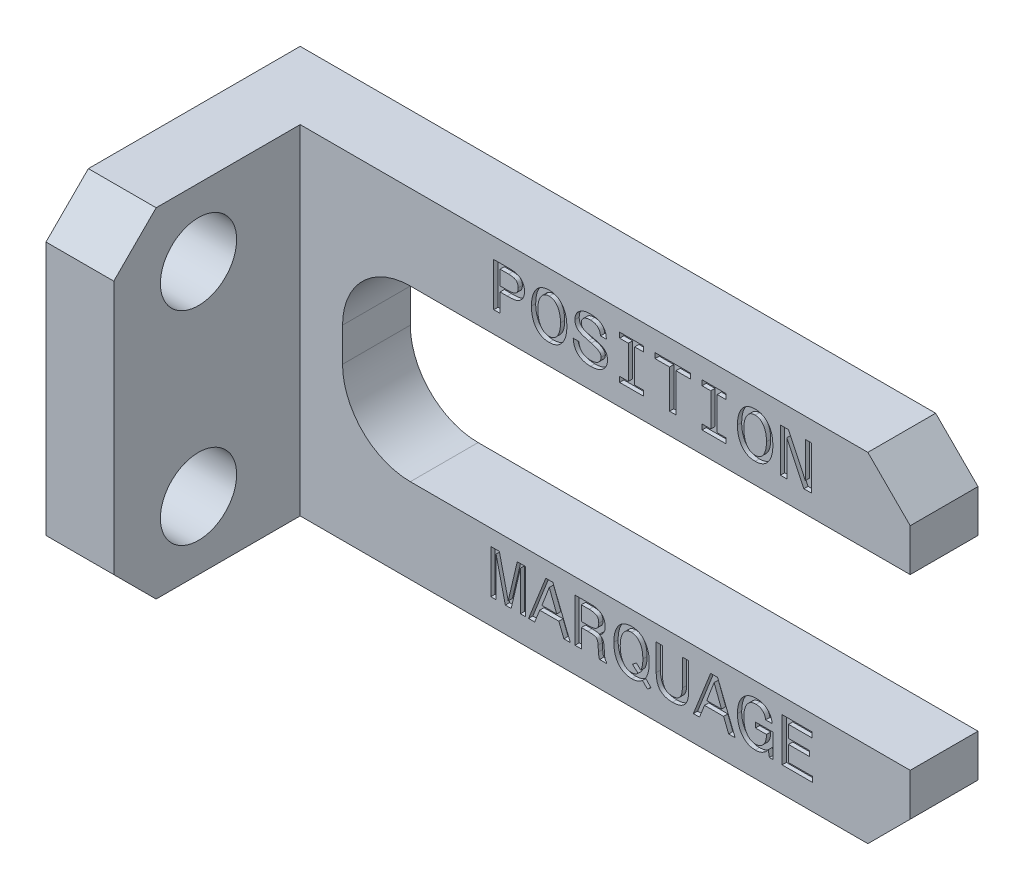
from build123d import *

# Parameters (mm, degrees)
BOSS_EXTRU_1_DEPTH      = 8
ESQUISSE2_W             = 8
ESQUISSE2_H             = 40
BOSS_EXTRU_2_DEPTH      = 22
CHANFREIN1_SIZE         = 5
ENL_V_MAT_EXTRU_1_DEPTH = 0.5
ESQUISSE4_R             = 4.5
ENL_V_MAT_EXTRU_2_DEPTH = 81.523288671


with BuildPart() as part:
    # Esquisse1 → Boss.-Extru.1 (new body)
    with BuildSketch(Plane.XY):
        with BuildLine():
            Line((80, -10), (80, -20))
            Line((80, -20), (0, -20))
            Line((0, -20), (0, 20))
            Line((0, 20), (80, 20))
            Line((80, 20), (80, 10))
            Line((80, 10), (21, 10))
            ThreePointArc((21, 10), (15.343145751, 7.656854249), (13, 2))
            Line((13, 2), (13, -2))
            ThreePointArc((13, -2), (15.343145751, -7.656854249), (21, -10))
            Line((21, -10), (80, -10))
        make_face()
    extrude(amount=BOSS_EXTRU_1_DEPTH)

    # Esquisse2 → Boss.-Extru.2 (add)
    with BuildSketch(Plane.XY.offset(8)):
        with Locations((4, 0)):
            Rectangle(ESQUISSE2_W, ESQUISSE2_H)
    extrude(amount=BOSS_EXTRU_2_DEPTH)

    # Chanfrein1
    chanfrein1_edges = [part.edges().sort_by_distance(p)[0] for p in [
        (80, 20, 4),
        (80, -20, 4),
        (4, -20, 30),
        (4, 20, 30),
    ]]
    chamfer(chanfrein1_edges, length=CHANFREIN1_SIZE)

    # Esquisse3 → Enl_v. mat.-Extru.1 (cut)
    # profile 1 of 16: a face of its own
    with BuildSketch(Plane.XY.offset(8)):
        with BuildLine():
            Line((30.843867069, 12.5), (30.843867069, 17.63663737))
            Line((30.843867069, 17.63663737), (32.797929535, 17.63663737))
            add(Edge.make_bspline(
                [(32.797929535, 17.63663737), (32.864684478, 17.635873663), (32.994537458, 17.634388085), (33.182524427, 17.615394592), (33.358310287, 17.587213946), (33.5215965, 17.546531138), (33.672803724, 17.494774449), (33.811131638, 17.429919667), (33.937136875, 17.35406905), (34.050093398, 17.265782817), (34.150293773, 17.166684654), (34.238159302, 17.056933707), (34.310398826, 16.934991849), (34.371441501, 16.803371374), (34.416796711, 16.660078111), (34.449802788, 16.506016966), (34.47057333, 16.341271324), (34.472678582, 16.227692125), (34.473757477, 16.169485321)],
                knots=[0, 0, 0, 0, 1.258612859, 2.448277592, 3.559908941, 4.614061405, 5.618382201, 6.569504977, 7.490302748, 8.386662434, 9.266815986, 10.143155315, 11.030480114, 11.933656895, 12.874106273, 13.858579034, 14.902569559, 16, 16, 16, 16], degree=3))
            add(Edge.make_bspline(
                [(34.473757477, 16.169485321), (34.472259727, 16.107318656), (34.469327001, 15.985590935), (34.442125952, 15.808563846), (34.397345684, 15.642130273), (34.333641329, 15.487039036), (34.253365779, 15.343144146), (34.15565294, 15.210466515), (34.039861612, 15.090158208), (33.951346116, 15.020926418), (33.906587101, 14.98591846)],
                knots=[0, 0, 0, 0, 1.091874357, 2.137984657, 3.138594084, 4.114089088, 5.076689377, 6.027026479, 7.002340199, 8, 8, 8, 8], degree=3))
            add(Edge.make_bspline(
                [(33.906587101, 14.98591846), (33.868221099, 14.960095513), (33.79104696, 14.908152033), (33.665156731, 14.845401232), (33.531167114, 14.795099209), (33.412777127, 14.761993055), (33.308875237, 14.740097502), (33.218232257, 14.728627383), (33.116005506, 14.715834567), (33.00128907, 14.708453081), (32.874342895, 14.70047944), (32.735180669, 14.69545076), (32.584276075, 14.692174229), (32.479745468, 14.691817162), (32.425523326, 14.691631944)],
                knots=[0, 0, 0, 0, 1.082587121, 2.17765007, 3.285867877, 4.431517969, 5.054329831, 5.771724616, 6.570950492, 7.467652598, 8.463862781, 9.551084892, 10.729698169, 12, 12, 12, 12], degree=3))
            Line((32.425523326, 14.691631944), (31.59724055, 14.691631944))
            Line((31.59724055, 14.691631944), (31.59724055, 12.5))
            Line((31.59724055, 12.5), (30.843867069, 12.5))
        make_face()
        with BuildLine():
            Line((32.595674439, 17.020240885), (31.59724055, 17.020240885))
            Line((31.59724055, 17.020240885), (31.59724055, 15.308028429))
            Line((31.59724055, 15.308028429), (32.535747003, 15.308028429))
            add(Edge.make_bspline(
                [(32.535747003, 15.308028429), (32.588917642, 15.308550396), (32.691072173, 15.309553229), (32.837772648, 15.319733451), (32.972335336, 15.333603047), (33.093775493, 15.356243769), (33.203424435, 15.383817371), (33.300255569, 15.417551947), (33.385636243, 15.456972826), (33.458151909, 15.504605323), (33.520705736, 15.559442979), (33.574770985, 15.62186439), (33.619769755, 15.6936089), (33.657270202, 15.772950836), (33.686240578, 15.860634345), (33.706303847, 15.956467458), (33.717820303, 16.060406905), (33.719511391, 16.13235827), (33.720383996, 16.169485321)],
                knots=[0, 0, 0, 0, 1.503607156, 2.888817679, 4.157862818, 5.32739254, 6.379632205, 7.352868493, 8.223883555, 9.032600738, 9.797591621, 10.570195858, 11.359484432, 12.185389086, 13.046826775, 13.965006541, 14.949939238, 16, 16, 16, 16], degree=3))
            add(Edge.make_bspline(
                [(33.720383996, 16.169485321), (33.719510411, 16.206252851), (33.717826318, 16.277133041), (33.706454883, 16.379352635), (33.685648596, 16.473433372), (33.65864439, 16.559845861), (33.622854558, 16.638299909), (33.579079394, 16.708575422), (33.525714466, 16.769850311), (33.465160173, 16.824648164), (33.393889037, 16.870680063), (33.313055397, 16.911791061), (33.220579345, 16.945436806), (33.117102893, 16.973219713), (33.002554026, 16.994246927), (32.876693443, 17.008642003), (32.739945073, 17.018651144), (32.644920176, 17.019698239), (32.595674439, 17.020240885)],
                knots=[0, 0, 0, 0, 1.081190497, 2.084311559, 3.018370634, 3.910683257, 4.741442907, 5.547534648, 6.335962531, 7.123412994, 7.940889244, 8.822783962, 9.785268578, 10.828497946, 11.970267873, 13.206245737, 14.552163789, 16, 16, 16, 16], degree=3))
        make_face(mode=Mode.SUBTRACT)
    # profile 2 of 16: a face of its own
    with BuildSketch(Plane.XY.offset(8)):
        with BuildLine():
            add(Edge.make_bspline(
                [(35.295619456, 15.1047032), (35.297182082, 15.206776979), (35.300219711, 15.405200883), (35.326069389, 15.694512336), (35.369463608, 15.966357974), (35.430275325, 16.221229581), (35.508206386, 16.458786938), (35.603567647, 16.679249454), (35.716004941, 16.883078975), (35.846805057, 17.068158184), (35.991938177, 17.234397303), (36.151246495, 17.379548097), (36.324854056, 17.500563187), (36.510296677, 17.601695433), (36.710169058, 17.678638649), (36.92262268, 17.734025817), (37.148344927, 17.768143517), (37.303065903, 17.77176033), (37.382378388, 17.773614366)],
                knots=[0, 0, 0, 0, 1.280076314, 2.488373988, 3.639490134, 4.730073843, 5.771382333, 6.771268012, 7.738592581, 8.685706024, 9.608281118, 10.501522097, 11.381555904, 12.256376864, 13.144550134, 14.060450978, 15.005755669, 16, 16, 16, 16], degree=3))
            add(Edge.make_bspline(
                [(37.382378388, 17.773614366), (37.461703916, 17.771853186), (37.616856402, 17.768408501), (37.842451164, 17.732907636), (38.054897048, 17.677429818), (38.254931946, 17.600503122), (38.440857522, 17.49870836), (38.614647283, 17.375930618), (38.774956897, 17.230461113), (38.92017061, 17.06278232), (39.050394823, 16.876512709), (39.164754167, 16.673210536), (39.25939202, 16.452098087), (39.339043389, 16.21504423), (39.399639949, 15.960689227), (39.441308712, 15.689727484), (39.469211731, 15.402781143), (39.471992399, 15.205721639), (39.473417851, 15.1047032)],
                knots=[0, 0, 0, 0, 0.994285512, 1.944719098, 2.85633111, 3.744541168, 4.625464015, 5.508112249, 6.407710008, 7.33369118, 8.284503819, 9.25404922, 10.253976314, 11.296739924, 12.387368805, 13.528989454, 14.733288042, 16, 16, 16, 16], degree=3))
            add(Edge.make_bspline(
                [(39.473417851, 15.1047032), (39.471993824, 15.003327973), (39.469215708, 14.805556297), (39.441286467, 14.517546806), (39.399755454, 14.245846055), (39.339062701, 13.991142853), (39.259185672, 13.753824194), (39.164731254, 13.531968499), (39.050716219, 13.327700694), (38.920061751, 13.141386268), (38.775399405, 12.973433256), (38.61386114, 12.829509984), (38.441616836, 12.704813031), (38.254276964, 12.605314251), (38.055397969, 12.525884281), (37.842207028, 12.472710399), (37.616897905, 12.436581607), (37.461717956, 12.433226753), (37.382378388, 12.431511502)],
                knots=[0, 0, 0, 0, 1.269650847, 2.476946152, 3.621603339, 4.710916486, 5.752422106, 6.755243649, 7.72751952, 8.677185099, 9.602049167, 10.497567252, 11.381740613, 12.259475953, 13.148245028, 14.057627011, 15.006913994, 16, 16, 16, 16], degree=3))
            add(Edge.make_bspline(
                [(37.382378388, 12.431511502), (37.30339153, 12.433215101), (37.148913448, 12.436546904), (36.924373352, 12.472886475), (36.711750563, 12.525627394), (36.513481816, 12.605646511), (36.326455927, 12.704449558), (36.155091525, 12.829892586), (35.993600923, 12.973380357), (35.84898589, 13.141401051), (35.718318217, 13.327696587), (35.604306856, 13.531969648), (35.509851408, 13.753823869), (35.429974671, 13.991142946), (35.369281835, 14.245846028), (35.327750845, 14.517546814), (35.299821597, 14.805556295), (35.297043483, 15.003327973), (35.295619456, 15.1047032)],
                knots=[0, 0, 0, 0, 0.989652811, 1.935507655, 2.845838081, 3.731374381, 4.610025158, 5.491484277, 6.387936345, 7.313765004, 8.264421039, 9.237710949, 10.241578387, 11.284170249, 12.374619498, 13.520470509, 14.729024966, 16, 16, 16, 16], degree=3))
        make_face()
        with BuildLine():
            add(Edge.make_bspline(
                [(36.048992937, 15.100422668), (36.049851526, 15.022622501), (36.05152367, 14.871102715), (36.06934259, 14.650365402), (36.096267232, 14.442208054), (36.136045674, 14.24706767), (36.185841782, 14.064846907), (36.247007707, 13.895391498), (36.31956421, 13.738597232), (36.403912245, 13.5952712), (36.497775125, 13.466856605), (36.599344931, 13.354431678), (36.709980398, 13.260162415), (36.828294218, 13.182163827), (36.95554949, 13.121953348), (37.090819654, 13.078898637), (37.234036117, 13.052599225), (37.332326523, 13.049490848), (37.382378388, 13.047907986)],
                knots=[0, 0, 0, 0, 1.363611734, 2.655703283, 3.879720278, 5.041130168, 6.144098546, 7.18859404, 8.195769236, 9.168518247, 10.099086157, 10.979935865, 11.818295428, 12.640428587, 13.457216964, 14.277945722, 15.12308809, 16, 16, 16, 16], degree=3))
            add(Edge.make_bspline(
                [(37.382378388, 13.047907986), (37.432787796, 13.049487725), (37.531788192, 13.052590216), (37.676041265, 13.078938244), (37.812151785, 13.121706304), (37.939614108, 13.18224592), (38.058800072, 13.260335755), (38.168945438, 13.35631908), (38.271333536, 13.468912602), (38.365110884, 13.59743338), (38.449451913, 13.740740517), (38.522275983, 13.897799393), (38.582982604, 14.067780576), (38.632873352, 14.249939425), (38.672898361, 14.44468086), (38.699604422, 14.652158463), (38.717532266, 14.872168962), (38.719192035, 15.022978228), (38.72004437, 15.100422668)],
                knots=[0, 0, 0, 0, 0.882134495, 1.732447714, 2.558179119, 3.374023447, 4.195206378, 5.045473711, 5.925305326, 6.854797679, 7.82642238, 8.832433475, 9.881595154, 10.983288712, 12.137235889, 13.359838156, 14.644208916, 16, 16, 16, 16], degree=3))
            add(Edge.make_bspline(
                [(38.72004437, 15.100422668), (38.719185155, 15.178222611), (38.71751179, 15.329741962), (38.699701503, 15.550482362), (38.672746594, 15.758628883), (38.63307272, 15.953806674), (38.582737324, 16.136545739), (38.522531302, 16.307061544), (38.449423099, 16.464375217), (38.365118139, 16.60769504), (38.27133174, 16.736212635), (38.168945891, 16.848806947), (38.058799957, 16.944790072), (37.939614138, 17.022879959), (37.812151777, 17.083419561), (37.676041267, 17.126187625), (37.531788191, 17.152535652), (37.432787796, 17.155638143), (37.382378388, 17.157217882)],
                knots=[0, 0, 0, 0, 1.359955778, 2.648583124, 3.869318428, 5.027614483, 6.127625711, 7.181054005, 8.185528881, 9.155669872, 10.083742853, 10.962230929, 11.811199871, 12.631128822, 13.445727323, 14.270197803, 15.11921256, 16, 16, 16, 16], degree=3))
            add(Edge.make_bspline(
                [(37.382378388, 17.157217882), (37.332326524, 17.15563502), (37.234036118, 17.152526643), (37.090819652, 17.126227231), (36.955549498, 17.083172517), (36.828294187, 17.022962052), (36.709980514, 16.944963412), (36.59934448, 16.85069435), (36.497776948, 16.738268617), (36.403904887, 16.609857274), (36.319593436, 16.466518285), (36.246751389, 16.309470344), (36.186088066, 16.139478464), (36.135846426, 15.956678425), (36.096418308, 15.761101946), (36.069245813, 15.552275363), (36.051544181, 15.330808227), (36.049858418, 15.178578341), (36.048992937, 15.100422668)],
                knots=[0, 0, 0, 0, 0.875571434, 1.71942189, 2.538896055, 3.354435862, 4.175312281, 5.012390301, 5.891893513, 6.821038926, 7.792300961, 8.797936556, 9.846706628, 10.947988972, 12.11374289, 13.335888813, 14.632230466, 16, 16, 16, 16], degree=3))
        make_face(mode=Mode.SUBTRACT)
    # profile 3 of 16: a face of its own
    with BuildSketch(Plane.XY.offset(8)):
        with BuildLine():
            add(Edge.make_bspline(
                [(40.911676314, 14.280700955), (40.912592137, 14.234631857), (40.914387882, 14.144299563), (40.931700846, 14.012715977), (40.960606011, 13.888259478), (41.001458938, 13.771447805), (41.052803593, 13.66131353), (41.11640921, 13.558948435), (41.191860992, 13.464528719), (41.277654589, 13.377808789), (41.372745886, 13.299523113), (41.477256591, 13.231790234), (41.590040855, 13.175067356), (41.710691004, 13.129138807), (41.838553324, 13.092910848), (41.97403801, 13.065606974), (42.118113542, 13.051171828), (42.216852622, 13.049015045), (42.267534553, 13.047907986)],
                knots=[0, 0, 0, 0, 1.067499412, 2.093153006, 3.069943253, 4.024464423, 4.956624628, 5.881346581, 6.811156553, 7.752550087, 8.704381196, 9.660798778, 10.633379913, 11.625416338, 12.648800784, 13.711002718, 14.825077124, 16, 16, 16, 16], degree=3))
            add(Edge.make_bspline(
                [(42.267534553, 13.047907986), (42.313579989, 13.048750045), (42.403327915, 13.050391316), (42.534108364, 13.062540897), (42.658507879, 13.080997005), (42.775152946, 13.110420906), (42.88577735, 13.145303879), (42.988435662, 13.189383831), (43.084705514, 13.240886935), (43.173029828, 13.300702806), (43.253351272, 13.366593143), (43.323227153, 13.438220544), (43.382097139, 13.515538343), (43.430127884, 13.597875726), (43.46841589, 13.685749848), (43.494655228, 13.779013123), (43.511375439, 13.877375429), (43.513271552, 13.944609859), (43.514239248, 13.978923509)],
                knots=[0, 0, 0, 0, 1.266693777, 2.468933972, 3.611356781, 4.72301081, 5.77519058, 6.799725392, 7.792166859, 8.774854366, 9.729902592, 10.646085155, 11.521568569, 12.396886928, 13.262911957, 14.151337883, 15.056519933, 16, 16, 16, 16], degree=3))
            add(Edge.make_bspline(
                [(43.514239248, 13.978923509), (43.513560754, 14.002549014), (43.512222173, 14.049159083), (43.497088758, 14.117710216), (43.475059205, 14.184023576), (43.443151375, 14.248297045), (43.402601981, 14.310129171), (43.352217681, 14.369600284), (43.293735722, 14.427260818), (43.22516852, 14.481585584), (43.149448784, 14.535680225), (43.063102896, 14.585704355), (42.967850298, 14.633007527), (42.865011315, 14.681037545), (42.75211862, 14.724426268), (42.630105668, 14.765579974), (42.499893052, 14.806956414), (42.409270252, 14.830461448), (42.362776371, 14.842520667)],
                knots=[0, 0, 0, 0, 0.733966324, 1.448020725, 2.174647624, 2.904404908, 3.674099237, 4.470001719, 5.325591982, 6.225335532, 7.189276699, 8.219217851, 9.326250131, 10.498479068, 11.749718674, 13.087159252, 14.505571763, 16, 16, 16, 16], degree=3))
            add(Edge.make_bspline(
                [(42.362776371, 14.842520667), (42.3267932, 14.851972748), (42.258843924, 14.869821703), (42.162776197, 14.892213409), (42.080427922, 14.91452186), (42.029632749, 14.926800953), (42.006422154, 14.932411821)],
                knots=[0, 0, 0, 0, 1.214692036, 2.293779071, 3.220351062, 4, 4, 4, 4], degree=3))
            add(Edge.make_bspline(
                [(42.006422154, 14.932411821), (41.929597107, 14.952262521), (41.782504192, 14.990269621), (41.572951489, 15.052580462), (41.383721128, 15.115837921), (41.215093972, 15.182661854), (41.066319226, 15.249081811), (40.937654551, 15.317704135), (40.829272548, 15.387473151), (40.73926231, 15.460654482), (40.666704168, 15.540244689), (40.60248383, 15.623516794), (40.549947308, 15.715591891), (40.507358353, 15.814864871), (40.472378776, 15.921013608), (40.450099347, 16.035009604), (40.433875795, 16.155465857), (40.432806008, 16.238270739), (40.432256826, 16.280779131)],
                knots=[0, 0, 0, 0, 1.66777316, 3.193198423, 4.594532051, 5.860193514, 7.004475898, 8.017601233, 8.922259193, 9.710446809, 10.447890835, 11.181206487, 11.916856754, 12.669057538, 13.449179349, 14.260910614, 15.107227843, 16, 16, 16, 16], degree=3))
            add(Edge.make_bspline(
                [(40.432256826, 16.280779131), (40.433528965, 16.335447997), (40.436019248, 16.442465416), (40.460419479, 16.598484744), (40.498922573, 16.746298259), (40.552506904, 16.886625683), (40.622577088, 17.018584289), (40.707547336, 17.14288496), (40.80943649, 17.257560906), (40.924532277, 17.36443931), (41.052575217, 17.459995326), (41.190846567, 17.544235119), (41.338315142, 17.615978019), (41.495825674, 17.673786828), (41.662366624, 17.71874175), (41.838495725, 17.75048626), (42.024166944, 17.770149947), (42.1511967, 17.772442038), (42.216168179, 17.773614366)],
                knots=[0, 0, 0, 0, 1.003787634, 1.964971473, 2.893330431, 3.806175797, 4.717938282, 5.632335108, 6.565769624, 7.530410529, 8.513487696, 9.495865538, 10.501256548, 11.521469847, 12.57394924, 13.666615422, 14.806551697, 16, 16, 16, 16], degree=3))
            add(Edge.make_bspline(
                [(42.216168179, 17.773614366), (42.290059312, 17.772554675), (42.433858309, 17.770492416), (42.643021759, 17.749548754), (42.839445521, 17.716832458), (43.023349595, 17.671223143), (43.194434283, 17.611371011), (43.352433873, 17.537265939), (43.497810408, 17.45033729), (43.630196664, 17.350607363), (43.74812591, 17.23830012), (43.850503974, 17.114115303), (43.937861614, 16.979710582), (44.00913035, 16.833863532), (44.06326199, 16.676609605), (44.102908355, 16.508910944), (44.126883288, 16.329985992), (44.129361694, 16.207015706), (44.130635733, 16.143802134)],
                knots=[0, 0, 0, 0, 1.242104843, 2.41725125, 3.530520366, 4.588106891, 5.599208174, 6.573211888, 7.517509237, 8.442405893, 9.354514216, 10.249200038, 11.142598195, 12.043914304, 12.971510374, 13.93315443, 14.937526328, 16, 16, 16, 16], degree=3))
            Line((44.130635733, 16.143802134), (44.130635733, 16.129890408))
            Line((44.130635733, 16.129890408), (43.44575075, 16.129890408))
            add(Edge.make_bspline(
                [(43.44575075, 16.129890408), (43.441437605, 16.170295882), (43.43302363, 16.249117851), (43.40929892, 16.363022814), (43.376878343, 16.469532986), (43.337751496, 16.568987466), (43.290317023, 16.661544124), (43.233362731, 16.745833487), (43.168892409, 16.823333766), (43.096747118, 16.893720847), (43.016098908, 16.955221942), (42.929659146, 17.010536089), (42.835114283, 17.055265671), (42.734322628, 17.093168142), (42.625530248, 17.121424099), (42.510144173, 17.143306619), (42.387610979, 17.154508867), (42.30393781, 17.156300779), (42.261113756, 17.157217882)],
                knots=[0, 0, 0, 0, 1.11087152, 2.167059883, 3.17628896, 4.152779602, 5.086569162, 6.014684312, 6.929058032, 7.839781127, 8.764763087, 9.69860361, 10.641118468, 11.61970255, 12.639673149, 13.711249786, 14.828614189, 16, 16, 16, 16], degree=3))
            add(Edge.make_bspline(
                [(42.261113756, 17.157217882), (42.221486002, 17.156761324), (42.143861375, 17.155866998), (42.030703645, 17.144210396), (41.92320775, 17.129138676), (41.821904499, 17.105371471), (41.726758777, 17.074382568), (41.637534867, 17.036953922), (41.554696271, 16.99301705), (41.478815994, 16.942734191), (41.409867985, 16.887297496), (41.350256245, 16.826336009), (41.298639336, 16.761622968), (41.25812476, 16.691319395), (41.225760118, 16.617015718), (41.201876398, 16.538118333), (41.187825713, 16.454647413), (41.186368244, 16.397476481), (41.185630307, 16.368530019)],
                knots=[0, 0, 0, 0, 1.271968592, 2.49158924, 3.64990378, 4.755770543, 5.828021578, 6.859861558, 7.859141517, 8.834499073, 9.779102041, 10.694426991, 11.567489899, 12.429968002, 13.291837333, 14.16520078, 15.071014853, 16, 16, 16, 16], degree=3))
            add(Edge.make_bspline(
                [(41.185630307, 16.368530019), (41.18607944, 16.33959138), (41.18694783, 16.283639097), (41.198369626, 16.202787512), (41.214576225, 16.12747872), (41.239916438, 16.05903243), (41.269437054, 15.995240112), (41.308764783, 15.938729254), (41.353585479, 15.886953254), (41.407785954, 15.839416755), (41.477265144, 15.795411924), (41.567291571, 15.753735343), (41.678994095, 15.70970633), (41.813829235, 15.667083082), (41.97046417, 15.62208884), (42.149507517, 15.575988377), (42.351351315, 15.530697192), (42.493645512, 15.501156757), (42.568241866, 15.485670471)],
                knots=[0, 0, 0, 0, 0.765324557, 1.479739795, 2.157723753, 2.79984765, 3.40795792, 4.012908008, 4.615125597, 5.217343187, 5.914005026, 6.783948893, 7.839467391, 9.09055614, 10.524991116, 12.153232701, 13.983369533, 16, 16, 16, 16], degree=3))
            add(Edge.make_bspline(
                [(42.568241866, 15.485670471), (42.651511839, 15.467049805), (42.811211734, 15.431338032), (43.038361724, 15.369806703), (43.243560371, 15.30755574), (43.426618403, 15.242343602), (43.58755582, 15.174633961), (43.726024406, 15.103050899), (43.843215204, 15.029944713), (43.938865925, 14.951068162), (44.01789236, 14.866531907), (44.084571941, 14.774599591), (44.141459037, 14.674913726), (44.187995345, 14.566120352), (44.223940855, 14.448785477), (44.249583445, 14.32264945), (44.264461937, 14.188314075), (44.266542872, 14.095962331), (44.267612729, 14.04848214)],
                knots=[0, 0, 0, 0, 1.65685685, 3.177614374, 4.569049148, 5.820220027, 6.949953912, 7.956926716, 8.844738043, 9.627039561, 10.35730988, 11.086133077, 11.827652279, 12.581717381, 13.379297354, 14.206675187, 15.078009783, 16, 16, 16, 16], degree=3))
            add(Edge.make_bspline(
                [(44.267612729, 14.04848214), (44.266071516, 13.988098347), (44.263056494, 13.86997156), (44.236452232, 13.697867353), (44.194914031, 13.534859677), (44.136522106, 13.380818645), (44.057885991, 13.237665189), (43.964954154, 13.103243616), (43.854136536, 12.978741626), (43.727000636, 12.865264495), (43.586275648, 12.762097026), (43.431583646, 12.675163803), (43.267513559, 12.597519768), (43.089722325, 12.537834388), (42.901105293, 12.488688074), (42.699945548, 12.457292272), (42.48780182, 12.43422392), (42.342155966, 12.432430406), (42.267534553, 12.431511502)],
                knots=[0, 0, 0, 0, 0.999627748, 1.955538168, 2.876974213, 3.782204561, 4.675771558, 5.575586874, 6.483800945, 7.429320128, 8.393665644, 9.367610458, 10.36417789, 11.395585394, 12.468905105, 13.588843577, 14.764647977, 16, 16, 16, 16], degree=3))
            add(Edge.make_bspline(
                [(42.267534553, 12.431511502), (42.191498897, 12.432887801), (42.043004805, 12.435575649), (41.826872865, 12.458249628), (41.623196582, 12.495537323), (41.432453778, 12.547518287), (41.254091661, 12.615179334), (41.089221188, 12.698653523), (40.936842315, 12.796971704), (40.797322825, 12.908949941), (40.672871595, 13.03642573), (40.561750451, 13.175652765), (40.467325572, 13.32904216), (40.387994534, 13.494816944), (40.323331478, 13.673241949), (40.276470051, 13.864636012), (40.240708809, 14.06800806), (40.231516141, 14.208494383), (40.226791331, 14.280700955)],
                knots=[0, 0, 0, 0, 1.175416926, 2.295534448, 3.355670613, 4.373932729, 5.348054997, 6.300162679, 7.225733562, 8.147401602, 9.060031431, 9.974808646, 10.896196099, 11.838540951, 12.812069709, 13.8246999, 14.881948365, 16, 16, 16, 16], degree=3))
            Line((40.226791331, 14.280700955), (40.911676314, 14.280700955))
        make_face()
    # profile 4 of 16: a face of its own
    with BuildSketch(Plane.XY.offset(8)):
        Polygon((46.733198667, 13.116396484), (46.733198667, 17.020240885), (45.705871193, 17.020240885), (45.705871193, 17.63663737), (48.513899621, 17.63663737), (48.513899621, 17.020240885), (47.486572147, 17.020240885), (47.486572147, 13.116396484), (48.513899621, 13.116396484), (48.513899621, 12.5), (45.705871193, 12.5), (45.705871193, 13.116396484), align=None)
    # profile 5 of 16: a face of its own
    with BuildSketch(Plane.XY.offset(8)):
        Polygon((51.595882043, 12.5), (51.595882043, 17.020240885), (49.883669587, 17.020240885), (49.883669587, 17.63663737), (54.061467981, 17.63663737), (54.061467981, 17.020240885), (52.349255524, 17.020240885), (52.349255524, 12.5), align=None)
    # profile 6 of 16: a face of its own
    with BuildSketch(Plane.XY.offset(8)):
        Polygon((56.45856542, 13.116396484), (56.45856542, 17.020240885), (55.431237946, 17.020240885), (55.431237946, 17.63663737), (58.239266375, 17.63663737), (58.239266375, 17.020240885), (57.211938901, 17.020240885), (57.211938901, 13.116396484), (58.239266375, 13.116396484), (58.239266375, 12.5), (55.431237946, 12.5), (55.431237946, 13.116396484), align=None)
    # profile 7 of 16: a face of its own
    with BuildSketch(Plane.XY.offset(8)):
        with BuildLine():
            add(Edge.make_bspline(
                [(59.60903634, 15.1047032), (59.610598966, 15.206776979), (59.613636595, 15.405200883), (59.639486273, 15.694512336), (59.682880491, 15.966357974), (59.743692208, 16.221229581), (59.821623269, 16.458786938), (59.916984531, 16.679249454), (60.029421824, 16.883078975), (60.160221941, 17.068158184), (60.30535506, 17.234397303), (60.464663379, 17.379548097), (60.63827094, 17.500563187), (60.823713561, 17.601695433), (61.023585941, 17.678638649), (61.236039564, 17.734025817), (61.461761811, 17.768143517), (61.616482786, 17.77176033), (61.695795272, 17.773614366)],
                knots=[0, 0, 0, 0, 1.280076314, 2.488373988, 3.639490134, 4.730073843, 5.771382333, 6.771268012, 7.738592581, 8.685706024, 9.608281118, 10.501522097, 11.381555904, 12.256376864, 13.144550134, 14.060450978, 15.005755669, 16, 16, 16, 16], degree=3))
            add(Edge.make_bspline(
                [(61.695795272, 17.773614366), (61.775120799, 17.771853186), (61.930273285, 17.768408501), (62.155868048, 17.732907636), (62.368313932, 17.677429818), (62.568348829, 17.600503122), (62.754274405, 17.49870836), (62.928064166, 17.375930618), (63.088373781, 17.230461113), (63.233587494, 17.06278232), (63.363811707, 16.876512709), (63.478171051, 16.673210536), (63.572808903, 16.452098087), (63.652460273, 16.21504423), (63.713056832, 15.960689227), (63.754725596, 15.689727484), (63.782628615, 15.402781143), (63.785409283, 15.205721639), (63.786834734, 15.1047032)],
                knots=[0, 0, 0, 0, 0.994285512, 1.944719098, 2.85633111, 3.744541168, 4.625464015, 5.508112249, 6.407710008, 7.33369118, 8.284503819, 9.25404922, 10.253976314, 11.296739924, 12.387368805, 13.528989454, 14.733288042, 16, 16, 16, 16], degree=3))
            add(Edge.make_bspline(
                [(63.786834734, 15.1047032), (63.785410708, 15.003327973), (63.782632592, 14.805556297), (63.754703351, 14.517546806), (63.713172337, 14.245846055), (63.652479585, 13.991142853), (63.572602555, 13.753824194), (63.478148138, 13.531968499), (63.364133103, 13.327700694), (63.233478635, 13.141386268), (63.088816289, 12.973433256), (62.927278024, 12.829509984), (62.75503372, 12.704813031), (62.567693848, 12.605314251), (62.368814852, 12.525884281), (62.155623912, 12.472710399), (61.930314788, 12.436581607), (61.77513484, 12.433226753), (61.695795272, 12.431511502)],
                knots=[0, 0, 0, 0, 1.269650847, 2.476946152, 3.621603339, 4.710916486, 5.752422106, 6.755243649, 7.72751952, 8.677185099, 9.602049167, 10.497567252, 11.381740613, 12.259475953, 13.148245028, 14.057627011, 15.006913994, 16, 16, 16, 16], degree=3))
            add(Edge.make_bspline(
                [(61.695795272, 12.431511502), (61.616808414, 12.433215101), (61.462330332, 12.436546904), (61.237790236, 12.472886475), (61.025167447, 12.525627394), (60.826898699, 12.605646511), (60.63987281, 12.704449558), (60.468508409, 12.829892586), (60.307017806, 12.973380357), (60.162402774, 13.141401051), (60.0317351, 13.327696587), (59.917723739, 13.531969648), (59.823268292, 13.753823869), (59.743391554, 13.991142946), (59.682698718, 14.245846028), (59.641167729, 14.517546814), (59.613238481, 14.805556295), (59.610460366, 15.003327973), (59.60903634, 15.1047032)],
                knots=[0, 0, 0, 0, 0.989652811, 1.935507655, 2.845838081, 3.731374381, 4.610025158, 5.491484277, 6.387936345, 7.313765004, 8.264421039, 9.237710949, 10.241578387, 11.284170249, 12.374619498, 13.520470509, 14.729024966, 16, 16, 16, 16], degree=3))
        make_face()
        with BuildLine():
            add(Edge.make_bspline(
                [(60.362409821, 15.100422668), (60.363268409, 15.022622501), (60.364940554, 14.871102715), (60.382759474, 14.650365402), (60.409684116, 14.442208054), (60.449462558, 14.24706767), (60.499258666, 14.064846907), (60.560424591, 13.895391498), (60.632981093, 13.738597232), (60.717329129, 13.5952712), (60.811192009, 13.466856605), (60.912761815, 13.354431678), (61.023397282, 13.260162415), (61.141711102, 13.182163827), (61.268966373, 13.121953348), (61.404236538, 13.078898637), (61.547453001, 13.052599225), (61.645743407, 13.049490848), (61.695795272, 13.047907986)],
                knots=[0, 0, 0, 0, 1.363611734, 2.655703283, 3.879720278, 5.041130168, 6.144098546, 7.18859404, 8.195769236, 9.168518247, 10.099086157, 10.979935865, 11.818295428, 12.640428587, 13.457216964, 14.277945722, 15.12308809, 16, 16, 16, 16], degree=3))
            add(Edge.make_bspline(
                [(61.695795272, 13.047907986), (61.74620468, 13.049487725), (61.845205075, 13.052590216), (61.989458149, 13.078938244), (62.125568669, 13.121706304), (62.253030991, 13.18224592), (62.372216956, 13.260335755), (62.482362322, 13.35631908), (62.58475042, 13.468912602), (62.678527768, 13.59743338), (62.762868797, 13.740740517), (62.835692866, 13.897799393), (62.896399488, 14.067780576), (62.946290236, 14.249939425), (62.986315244, 14.44468086), (63.013021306, 14.652158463), (63.030949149, 14.872168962), (63.032608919, 15.022978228), (63.033461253, 15.100422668)],
                knots=[0, 0, 0, 0, 0.882134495, 1.732447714, 2.558179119, 3.374023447, 4.195206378, 5.045473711, 5.925305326, 6.854797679, 7.82642238, 8.832433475, 9.881595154, 10.983288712, 12.137235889, 13.359838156, 14.644208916, 16, 16, 16, 16], degree=3))
            add(Edge.make_bspline(
                [(63.033461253, 15.100422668), (63.032602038, 15.178222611), (63.030928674, 15.329741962), (63.013118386, 15.550482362), (62.986163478, 15.758628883), (62.946489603, 15.953806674), (62.896154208, 16.136545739), (62.835948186, 16.307061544), (62.762839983, 16.464375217), (62.678535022, 16.60769504), (62.584748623, 16.736212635), (62.482362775, 16.848806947), (62.372216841, 16.944790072), (62.253031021, 17.022879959), (62.12556866, 17.083419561), (61.989458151, 17.126187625), (61.845205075, 17.152535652), (61.74620468, 17.155638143), (61.695795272, 17.157217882)],
                knots=[0, 0, 0, 0, 1.359955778, 2.648583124, 3.869318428, 5.027614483, 6.127625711, 7.181054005, 8.185528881, 9.155669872, 10.083742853, 10.962230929, 11.811199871, 12.631128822, 13.445727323, 14.270197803, 15.11921256, 16, 16, 16, 16], degree=3))
            add(Edge.make_bspline(
                [(61.695795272, 17.157217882), (61.645743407, 17.15563502), (61.547453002, 17.152526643), (61.404236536, 17.126227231), (61.268966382, 17.083172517), (61.141711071, 17.022962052), (61.023397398, 16.944963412), (60.912761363, 16.85069435), (60.811193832, 16.738268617), (60.71732177, 16.609857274), (60.633010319, 16.466518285), (60.560168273, 16.309470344), (60.49950495, 16.139478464), (60.449263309, 15.956678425), (60.409835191, 15.761101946), (60.382662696, 15.552275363), (60.364961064, 15.330808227), (60.363275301, 15.178578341), (60.362409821, 15.100422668)],
                knots=[0, 0, 0, 0, 0.875571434, 1.71942189, 2.538896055, 3.354435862, 4.175312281, 5.012390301, 5.891893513, 6.821038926, 7.792300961, 8.797936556, 9.846706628, 10.947988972, 12.11374289, 13.335888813, 14.632230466, 16, 16, 16, 16], degree=3))
        make_face(mode=Mode.SUBTRACT)
    # profile 8 of 16: a face of its own
    with BuildSketch(Plane.XY.offset(8)):
        Polygon((64.677185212, 12.5), (64.677185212, 17.63663737), (65.630673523, 17.63663737), (67.622190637, 13.425664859), (67.622190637, 17.63663737), (68.375564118, 17.63663737), (68.375564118, 12.5), (67.447758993, 12.5), (65.430558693, 16.71097251), (65.430558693, 12.5), align=None)
    # profile 9 of 16: a face of its own
    with BuildSketch(Plane.XY.offset(8)):
        Polygon((30.501424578, -17.005048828), (30.501424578, -11.868411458), (31.505209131, -11.868411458), (32.55393926, -16.398283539), (33.620861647, -11.868411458), (34.610734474, -11.868411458), (34.610734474, -17.005048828), (33.994337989, -17.005048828), (33.994337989, -12.342480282), (32.898522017, -17.005048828), (32.213637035, -17.005048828), (31.117821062, -12.342480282), (31.117821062, -17.005048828), align=None)
    # profile 10 of 16: a face of its own
    with BuildSketch(Plane.XY.offset(8)):
        Polygon((34.953176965, -17.005048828), (36.98749939, -11.868411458), (37.817922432, -11.868411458), (39.88434884, -17.005048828), (39.121344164, -17.005048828), (38.525280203, -15.498301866), (36.27265069, -15.498301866), (35.676586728, -17.005048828), align=None)
        Polygon((36.530552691, -14.881905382), (38.274869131, -14.881905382), (37.400570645, -12.607873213), align=None, mode=Mode.SUBTRACT)
    # profile 11 of 16: a face of its own
    with BuildSketch(Plane.XY.offset(8)):
        with BuildLine():
            Line((40.432256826, -17.005048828), (40.432256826, -11.868411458))
            Line((40.432256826, -11.868411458), (42.315690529, -11.868411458))
            add(Edge.make_bspline(
                [(42.315690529, -11.868411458), (42.382090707, -11.869155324), (42.510880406, -11.870598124), (42.697776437, -11.889807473), (42.872845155, -11.917869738), (43.035878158, -11.958272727), (43.186823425, -12.010723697), (43.325161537, -12.07497577), (43.452120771, -12.150076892), (43.565632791, -12.238223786), (43.666694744, -12.336828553), (43.754723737, -12.446228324), (43.828199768, -12.56672754), (43.890197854, -12.697332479), (43.936806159, -12.839086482), (43.969655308, -12.991541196), (43.990492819, -13.15413402), (43.99258583, -13.266296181), (43.993658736, -13.323792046)],
                knots=[0, 0, 0, 0, 1.257289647, 2.438637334, 3.555065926, 4.613767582, 5.616042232, 6.577392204, 7.498676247, 8.404239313, 9.293007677, 10.167847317, 11.056744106, 11.960540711, 12.900736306, 13.87625418, 14.911338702, 16, 16, 16, 16], degree=3))
            add(Edge.make_bspline(
                [(43.993658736, -13.323792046), (43.991311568, -13.391327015), (43.986773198, -13.521909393), (43.954415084, -13.710150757), (43.895297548, -13.8812002), (43.816443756, -14.037256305), (43.713210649, -14.175750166), (43.588309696, -14.297065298), (43.441300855, -14.401180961), (43.331071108, -14.453677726), (43.274529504, -14.480605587)],
                knots=[0, 0, 0, 0, 1.116396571, 2.158610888, 3.143231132, 4.097943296, 5.037917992, 5.984528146, 6.966177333, 8, 8, 8, 8], degree=3))
            add(Edge.make_bspline(
                [(43.274529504, -14.480605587), (43.321513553, -14.495504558), (43.411026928, -14.523889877), (43.529837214, -14.588168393), (43.629368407, -14.66319397), (43.693679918, -14.740122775), (43.735938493, -14.809491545), (43.763215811, -14.871291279), (43.788541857, -14.941367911), (43.811494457, -15.020213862), (43.828822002, -15.108467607), (43.844676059, -15.205558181), (43.859198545, -15.31144137), (43.864589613, -15.385182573), (43.867383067, -15.423392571)],
                knots=[0, 0, 0, 0, 1.459970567, 2.781516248, 3.988652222, 5.138189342, 5.731927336, 6.395218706, 7.138744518, 7.942959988, 8.829577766, 9.806021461, 10.863160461, 12, 12, 12, 12], degree=3))
            Line((43.867383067, -15.423392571), (43.925170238, -16.267727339))
            add(Edge.make_bspline(
                [(43.925170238, -16.267727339), (43.928701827, -16.310208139), (43.9353093, -16.389688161), (43.950224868, -16.499737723), (43.972064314, -16.59148098), (43.99578449, -16.667617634), (44.027740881, -16.730504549), (44.068674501, -16.782311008), (44.115335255, -16.828440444), (44.152598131, -16.851265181), (44.171300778, -16.862721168)],
                knots=[0, 0, 0, 0, 1.518907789, 2.841820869, 3.951651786, 4.87606199, 5.677582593, 6.447860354, 7.220964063, 8, 8, 8, 8], degree=3))
            Line((44.171300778, -16.862721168), (44.171300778, -17.005048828))
            Line((44.171300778, -17.005048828), (43.343018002, -17.005048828))
            add(Edge.make_bspline(
                [(43.343018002, -17.005048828), (43.334065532, -16.98954694), (43.314532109, -16.955723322), (43.292198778, -16.897123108), (43.271965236, -16.828277), (43.252397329, -16.749170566), (43.236738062, -16.65685133), (43.223327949, -16.550750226), (43.2102259, -16.430201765), (43.203979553, -16.344801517), (43.200690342, -16.299831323)],
                knots=[0, 0, 0, 0, 0.591810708, 1.291273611, 2.068266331, 2.967529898, 3.986710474, 5.165728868, 6.507525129, 8, 8, 8, 8], degree=3))
            Line((43.200690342, -16.299831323), (43.161095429, -15.627787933))
            add(Edge.make_bspline(
                [(43.161095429, -15.627787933), (43.157859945, -15.587452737), (43.15165977, -15.510158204), (43.137494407, -15.399466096), (43.115779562, -15.300251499), (43.090763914, -15.211469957), (43.059405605, -15.134294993), (43.025071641, -15.066563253), (42.982502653, -15.011682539), (42.934553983, -14.964604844), (42.873276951, -14.926996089), (42.795884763, -14.897059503), (42.701311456, -14.870449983), (42.588021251, -14.849990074), (42.45696784, -14.832949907), (42.307277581, -14.82196109), (42.139558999, -14.814146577), (42.021414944, -14.81366823), (41.959336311, -14.813416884)],
                knots=[0, 0, 0, 0, 1.132333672, 2.169896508, 3.119412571, 3.9722445, 4.747028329, 5.448092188, 6.088941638, 6.681988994, 7.318939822, 8.084473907, 8.997616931, 10.06453268, 11.302618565, 12.694404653, 14.263079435, 16, 16, 16, 16], degree=3))
            Line((41.959336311, -14.813416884), (41.185630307, -14.813416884))
            Line((41.185630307, -14.813416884), (41.185630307, -17.005048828))
            Line((41.185630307, -17.005048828), (40.432256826, -17.005048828))
        make_face()
        with BuildLine():
            Line((42.105944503, -12.484807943), (41.185630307, -12.484807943))
            Line((41.185630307, -12.484807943), (41.185630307, -14.197020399))
            Line((41.185630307, -14.197020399), (42.054578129, -14.197020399))
            add(Edge.make_bspline(
                [(42.054578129, -14.197020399), (42.107750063, -14.196507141), (42.209907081, -14.19552104), (42.356944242, -14.18520127), (42.491566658, -14.171699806), (42.613247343, -14.148480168), (42.723021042, -14.121437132), (42.82015178, -14.087475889), (42.90553869, -14.048080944), (42.978052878, -14.0004423), (43.040607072, -13.945606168), (43.094672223, -13.88318435), (43.13967102, -13.811439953), (43.177171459, -13.732097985), (43.206141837, -13.644414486), (43.226205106, -13.54858137), (43.237721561, -13.444641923), (43.23941265, -13.372690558), (43.240285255, -13.335563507)],
                knots=[0, 0, 0, 0, 1.502679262, 2.887034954, 4.165317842, 5.324211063, 6.385569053, 7.358204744, 8.228682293, 9.036900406, 9.801419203, 10.573546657, 11.362348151, 12.18774313, 13.048649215, 13.966262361, 14.950587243, 16, 16, 16, 16], degree=3))
            add(Edge.make_bspline(
                [(43.240285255, -13.335563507), (43.239409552, -13.298796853), (43.237721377, -13.227918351), (43.22637822, -13.125687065), (43.205474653, -13.031646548), (43.178760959, -12.944951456), (43.141649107, -12.866671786), (43.096777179, -12.796749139), (43.043504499, -12.735194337), (42.982771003, -12.680085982), (42.910515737, -12.634395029), (42.828918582, -12.593506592), (42.735911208, -12.559387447), (42.631626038, -12.531882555), (42.516033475, -12.510793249), (42.389099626, -12.496415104), (42.251284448, -12.486397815), (42.15554694, -12.485350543), (42.105944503, -12.484807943)],
                knots=[0, 0, 0, 0, 1.075810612, 2.073940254, 3.003351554, 3.891224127, 4.722252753, 5.529949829, 6.314454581, 7.097986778, 7.920120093, 8.80694923, 9.764644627, 10.812760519, 11.959109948, 13.199301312, 14.548933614, 16, 16, 16, 16], degree=3))
        make_face(mode=Mode.SUBTRACT)
    # profile 12 of 16: a face of its own
    with BuildSketch(Plane.XY.offset(8)):
        with BuildLine():
            add(Edge.make_bspline(
                [(48.397255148, -16.618730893), (48.356561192, -16.654190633), (48.275186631, -16.725098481), (48.139608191, -16.816818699), (47.992842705, -16.894325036), (47.836110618, -16.960003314), (47.670181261, -17.011213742), (47.495722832, -17.04757286), (47.313041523, -17.06915907), (47.188420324, -17.072058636), (47.124867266, -17.073537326)],
                knots=[0, 0, 0, 0, 0.93561387, 1.870920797, 2.83143004, 3.810474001, 4.814461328, 5.838665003, 6.897784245, 8, 8, 8, 8], degree=3))
            add(Edge.make_bspline(
                [(47.124867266, -17.073537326), (47.044840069, -17.071684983), (46.888696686, -17.068070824), (46.661224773, -17.033966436), (46.447041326, -16.978914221), (46.246437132, -16.899993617), (46.058955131, -16.799853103), (45.883733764, -16.678090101), (45.723079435, -16.532550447), (45.576097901, -16.365890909), (45.444951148, -16.179945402), (45.330830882, -15.975788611), (45.234454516, -15.754629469), (45.1569579, -15.516079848), (45.09590406, -15.261287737), (45.052686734, -14.989397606), (45.025299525, -14.700545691), (45.022447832, -14.502072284), (45.02098621, -14.400345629)],
                knots=[0, 0, 0, 0, 0.999025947, 1.949228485, 2.865643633, 3.755907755, 4.63495197, 5.514989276, 6.414128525, 7.335824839, 8.2852227, 9.250710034, 10.252315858, 11.293540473, 12.379604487, 13.52155173, 14.729682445, 16, 16, 16, 16], degree=3))
            add(Edge.make_bspline(
                [(45.02098621, -14.400345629), (45.022565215, -14.29863014), (45.025639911, -14.100566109), (45.051327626, -13.811944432), (45.094975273, -13.540501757), (45.155584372, -13.285938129), (45.233836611, -13.048159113), (45.328648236, -12.827102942), (45.441400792, -12.623048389), (45.572178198, -12.437978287), (45.71725355, -12.271646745), (45.876957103, -12.126703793), (46.04986165, -12.004331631), (46.235711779, -11.903421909), (46.43552234, -11.826391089), (46.647993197, -11.771028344), (46.873710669, -11.736903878), (47.028432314, -11.733288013), (47.107745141, -11.731434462)],
                knots=[0, 0, 0, 0, 1.275779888, 2.484244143, 3.631101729, 4.721835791, 5.76328784, 6.767417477, 7.734875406, 8.682119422, 9.604821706, 10.49818583, 11.380919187, 12.255860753, 13.144156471, 14.060183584, 15.005618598, 16, 16, 16, 16], degree=3))
            add(Edge.make_bspline(
                [(47.107745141, -11.731434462), (47.187056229, -11.733311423), (47.34212753, -11.736981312), (47.567872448, -11.770845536), (47.780556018, -11.82624691), (47.97973366, -11.905036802), (48.166564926, -12.004975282), (48.339958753, -12.128155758), (48.500339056, -12.273487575), (48.645533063, -12.441204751), (48.775762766, -12.627463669), (48.890120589, -12.830768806), (48.984758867, -13.051880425), (49.064410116, -13.288934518), (49.12500671, -13.543289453), (49.166675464, -13.814251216), (49.194578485, -14.101197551), (49.197359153, -14.298257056), (49.198784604, -14.399275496)],
                knots=[0, 0, 0, 0, 0.994357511, 1.944196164, 2.855874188, 3.745781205, 4.624640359, 5.507352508, 6.407015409, 7.333063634, 8.283945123, 9.253560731, 10.253560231, 11.29639935, 12.387107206, 13.528810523, 14.733196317, 16, 16, 16, 16], degree=3))
            add(Edge.make_bspline(
                [(49.198784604, -14.399275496), (49.197726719, -14.491347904), (49.19567377, -14.670025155), (49.174915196, -14.929061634), (49.142098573, -15.171027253), (49.096560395, -15.397248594), (49.035519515, -15.61051578), (48.96219382, -15.814059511), (48.873306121, -16.009344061), (48.802074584, -16.132364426), (48.766450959, -16.193888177)],
                knots=[0, 0, 0, 0, 1.181383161, 2.292611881, 3.332339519, 4.313616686, 5.251165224, 6.176519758, 7.088058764, 8, 8, 8, 8], degree=3))
            Line((48.766450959, -16.193888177), (49.404250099, -16.860580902))
            Line((49.404250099, -16.860580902), (48.996529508, -17.210514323))
            Line((48.996529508, -17.210514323), (48.397255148, -16.618730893))
        make_face()
        with BuildLine():
            Line((47.873960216, -16.152152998), (47.225459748, -15.555018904))
            Line((47.225459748, -15.555018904), (47.674915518, -15.182612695))
            Line((47.674915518, -15.182612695), (48.214262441, -15.679154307))
            add(Edge.make_bspline(
                [(48.214262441, -15.679154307), (48.232702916, -15.632283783), (48.269902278, -15.537733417), (48.314980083, -15.390803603), (48.355045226, -15.239167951), (48.388157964, -15.082062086), (48.413794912, -14.919532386), (48.431444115, -14.751995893), (48.444209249, -14.57996801), (48.445007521, -14.463507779), (48.445411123, -14.40462616)],
                knots=[0, 0, 0, 0, 0.927141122, 1.870291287, 2.827787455, 3.814574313, 4.825335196, 5.856067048, 6.916039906, 8, 8, 8, 8], degree=3))
            add(Edge.make_bspline(
                [(48.445411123, -14.40462616), (48.444557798, -14.326825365), (48.442895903, -14.175304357), (48.424975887, -13.954223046), (48.398236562, -13.745687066), (48.35838902, -13.550187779), (48.308335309, -13.367706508), (48.247646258, -13.197721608), (48.174817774, -13.040663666), (48.090477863, -12.897356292), (47.996700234, -12.768835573), (47.894312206, -12.656242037), (47.784166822, -12.560258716), (47.664980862, -12.48216888), (47.537518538, -12.421629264), (47.401408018, -12.378861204), (47.257154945, -12.352513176), (47.15815455, -12.349410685), (47.107745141, -12.347830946)],
                knots=[0, 0, 0, 0, 1.359929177, 2.648531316, 3.875424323, 5.033697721, 6.133687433, 7.181226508, 8.185681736, 9.155803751, 10.083858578, 10.962329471, 11.811281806, 12.631194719, 13.445777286, 14.270231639, 15.119229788, 16, 16, 16, 16], degree=3))
            add(Edge.make_bspline(
                [(47.107745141, -12.347830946), (47.057693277, -12.349413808), (46.959402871, -12.352522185), (46.816186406, -12.378821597), (46.680916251, -12.421876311), (46.553660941, -12.482086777), (46.435347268, -12.560085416), (46.324711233, -12.654354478), (46.223143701, -12.766780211), (46.12927164, -12.895191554), (46.044960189, -13.038530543), (45.972118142, -13.195578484), (45.91145482, -13.365570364), (45.861213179, -13.548370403), (45.821785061, -13.743946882), (45.794612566, -13.952773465), (45.776910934, -14.174240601), (45.775225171, -14.326470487), (45.774359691, -14.40462616)],
                knots=[0, 0, 0, 0, 0.875571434, 1.71942189, 2.538896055, 3.354435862, 4.175312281, 5.012390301, 5.891893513, 6.821038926, 7.792300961, 8.797936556, 9.846706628, 10.947988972, 12.11374289, 13.335888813, 14.632230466, 16, 16, 16, 16], degree=3))
            add(Edge.make_bspline(
                [(45.774359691, -14.40462616), (45.775212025, -14.482070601), (45.776871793, -14.632879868), (45.794799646, -14.852890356), (45.821505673, -15.060367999), (45.861530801, -15.255109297), (45.911421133, -15.437268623), (45.972129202, -15.607248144), (46.044948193, -15.764312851), (46.129307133, -15.90759942), (46.223022, -16.036191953), (46.325444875, -16.14833735), (46.434593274, -16.245049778), (46.553756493, -16.322774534), (46.680890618, -16.383125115), (46.816193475, -16.426142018), (46.959401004, -16.452451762), (47.057692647, -16.455558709), (47.107745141, -16.457140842)],
                knots=[0, 0, 0, 0, 1.357747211, 2.643971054, 3.868337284, 5.023949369, 6.127232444, 7.177907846, 8.185370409, 9.158396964, 10.089230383, 10.970331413, 11.817102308, 12.639470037, 13.45649146, 14.277454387, 15.12283789, 16, 16, 16, 16], degree=3))
            add(Edge.make_bspline(
                [(47.107745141, -16.457140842), (47.143819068, -16.456438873), (47.214466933, -16.455064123), (47.318434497, -16.44065856), (47.4178873, -16.416940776), (47.514420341, -16.385139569), (47.607028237, -16.341134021), (47.698539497, -16.288570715), (47.788432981, -16.225485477), (47.845101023, -16.176897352), (47.873960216, -16.152152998)],
                knots=[0, 0, 0, 0, 1.024132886, 2.005681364, 2.973962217, 3.925560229, 4.88655127, 5.88062259, 6.920669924, 8, 8, 8, 8], degree=3))
        make_face(mode=Mode.SUBTRACT)
    # profile 13 of 16: a face of its own
    with BuildSketch(Plane.XY.offset(8)):
        with BuildLine():
            Line((50.020646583, -15.003900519), (50.020646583, -11.868411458))
            Line((50.020646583, -11.868411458), (50.774020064, -11.868411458))
            Line((50.774020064, -11.868411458), (50.774020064, -15.0424253))
            add(Edge.make_bspline(
                [(50.774020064, -15.0424253), (50.774683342, -15.100600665), (50.775967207, -15.213207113), (50.790290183, -15.376163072), (50.81242134, -15.527400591), (50.842802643, -15.667250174), (50.883880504, -15.795266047), (50.932377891, -15.912175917), (50.990804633, -16.017412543), (51.058135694, -16.111393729), (51.13620652, -16.192982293), (51.22225307, -16.265193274), (51.32009106, -16.323507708), (51.425898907, -16.373359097), (51.541972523, -16.410174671), (51.666764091, -16.438571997), (51.801666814, -16.45414788), (51.89476906, -16.456124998), (51.942605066, -16.457140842)],
                knots=[0, 0, 0, 0, 1.325267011, 2.565237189, 3.72392991, 4.806545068, 5.8218978, 6.783515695, 7.68587296, 8.558945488, 9.409868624, 10.252835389, 11.110139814, 11.997435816, 12.912479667, 13.878723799, 14.910086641, 16, 16, 16, 16], degree=3))
            add(Edge.make_bspline(
                [(51.942605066, -16.457140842), (51.989756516, -16.456307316), (52.081536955, -16.454684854), (52.214238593, -16.436578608), (52.338270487, -16.410877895), (52.452922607, -16.372073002), (52.557771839, -16.321460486), (52.654541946, -16.261559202), (52.74050932, -16.189052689), (52.817450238, -16.105632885), (52.88471014, -16.010736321), (52.943953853, -15.905453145), (52.992979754, -15.78857451), (53.033832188, -15.660819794), (53.06400658, -15.521661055), (53.086404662, -15.371898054), (53.100674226, -15.211068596), (53.101962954, -15.099887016), (53.102629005, -15.0424253)],
                knots=[0, 0, 0, 0, 1.079435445, 2.101124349, 3.062816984, 3.97760738, 4.865767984, 5.725038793, 6.577756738, 7.433640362, 8.318033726, 9.236357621, 10.195616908, 11.216423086, 12.304852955, 13.453606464, 14.683953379, 16, 16, 16, 16], degree=3))
            Line((53.102629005, -15.0424253), (53.102629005, -11.868411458))
            Line((53.102629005, -11.868411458), (53.856002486, -11.868411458))
            Line((53.856002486, -11.868411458), (53.856002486, -15.003900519))
            add(Edge.make_bspline(
                [(53.856002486, -15.003900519), (53.854534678, -15.089193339), (53.851698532, -15.253998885), (53.830808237, -15.493059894), (53.793143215, -15.714709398), (53.742953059, -15.91999758), (53.675756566, -16.107435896), (53.596716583, -16.279119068), (53.498889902, -16.431974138), (53.388623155, -16.569450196), (53.261801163, -16.689489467), (53.119316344, -16.793008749), (52.960356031, -16.879625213), (52.786269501, -16.951941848), (52.595618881, -17.005491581), (52.389799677, -17.04484381), (52.168316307, -17.070132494), (52.015088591, -17.072379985), (51.936184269, -17.073537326)],
                knots=[0, 0, 0, 0, 1.259756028, 2.434141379, 3.540239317, 4.577849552, 5.551060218, 6.477300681, 7.363066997, 8.224589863, 9.074303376, 9.934245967, 10.818538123, 11.742182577, 12.712679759, 13.737706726, 14.835036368, 16, 16, 16, 16], degree=3))
            add(Edge.make_bspline(
                [(51.936184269, -17.073537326), (51.857633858, -17.072400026), (51.705466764, -17.070196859), (51.485432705, -17.044737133), (51.28099728, -17.00555144), (51.091179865, -16.951685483), (50.917559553, -16.879932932), (50.759251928, -16.792725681), (50.616943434, -16.689174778), (50.489107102, -16.569821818), (50.378797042, -16.431962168), (50.281220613, -16.278856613), (50.200588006, -16.107738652), (50.133899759, -15.919936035), (50.083050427, -15.714846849), (50.047669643, -15.492864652), (50.024443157, -15.254087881), (50.021941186, -15.089212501), (50.020646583, -15.003900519)],
                knots=[0, 0, 0, 0, 1.161503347, 2.250053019, 3.271495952, 4.238434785, 5.163517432, 6.044568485, 6.90585008, 7.760722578, 8.623586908, 9.510732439, 10.440678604, 11.415404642, 12.454630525, 13.561583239, 14.738282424, 16, 16, 16, 16], degree=3))
        make_face()
    # profile 14 of 16: a face of its own
    with BuildSketch(Plane.XY.offset(8)):
        Polygon((54.403910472, -17.005048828), (56.438232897, -11.868411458), (57.268655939, -11.868411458), (59.335082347, -17.005048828), (58.572077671, -17.005048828), (57.97601371, -15.498301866), (55.723384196, -15.498301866), (55.127320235, -17.005048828), align=None)
        Polygon((55.981286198, -14.881905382), (57.725602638, -14.881905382), (56.851304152, -12.607873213), align=None, mode=Mode.SUBTRACT)
    # profile 15 of 16: a face of its own
    with BuildSketch(Plane.XY.offset(8)):
        with BuildLine():
            add(Edge.make_bspline(
                [(63.250698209, -16.266657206), (63.202937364, -16.330655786), (63.109270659, -16.456167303), (62.946293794, -16.620456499), (62.770317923, -16.759760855), (62.582203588, -16.875555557), (62.380249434, -16.965011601), (62.165497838, -17.028134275), (61.937934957, -17.06630234), (61.781911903, -17.0710912), (61.702216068, -17.073537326)],
                knots=[0, 0, 0, 0, 1.051879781, 2.062905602, 3.040562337, 4.005282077, 4.967522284, 5.9437299, 6.949667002, 8, 8, 8, 8], degree=3))
            add(Edge.make_bspline(
                [(61.702216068, -17.073537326), (61.626825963, -17.07123992), (61.478460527, -17.066718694), (61.261402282, -17.032121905), (61.055112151, -16.973714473), (60.859475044, -16.893452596), (60.674657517, -16.789738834), (60.50133319, -16.661927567), (60.338347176, -16.511629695), (60.188072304, -16.338915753), (60.051564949, -16.148665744), (59.933542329, -15.941312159), (59.832599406, -15.720101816), (59.750084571, -15.484075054), (59.687632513, -15.233133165), (59.641367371, -14.968585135), (59.614845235, -14.689108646), (59.611003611, -14.498139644), (59.60903634, -14.400345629)],
                knots=[0, 0, 0, 0, 0.950994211, 1.871527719, 2.764910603, 3.650915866, 4.53357649, 5.432024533, 6.362147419, 7.325417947, 8.315886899, 9.311852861, 10.331021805, 11.380133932, 12.461959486, 13.590419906, 14.766069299, 16, 16, 16, 16], degree=3))
            add(Edge.make_bspline(
                [(59.60903634, -14.400345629), (59.610847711, -14.300037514), (59.61438105, -14.104372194), (59.642940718, -13.819058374), (59.687538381, -13.549205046), (59.754643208, -13.296491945), (59.837445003, -13.059143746), (59.940819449, -12.838922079), (60.061913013, -12.634046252), (60.202144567, -12.447022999), (60.358019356, -12.278531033), (60.529058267, -12.132109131), (60.713728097, -12.008050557), (60.911529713, -11.905397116), (61.123880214, -11.827384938), (61.349319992, -11.772243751), (61.588003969, -11.736586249), (61.752024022, -11.733178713), (61.835982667, -11.731434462)],
                knots=[0, 0, 0, 0, 1.2262756, 2.392025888, 3.502770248, 4.567068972, 5.585176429, 6.572519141, 7.536738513, 8.490213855, 9.42534551, 10.337948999, 11.236783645, 12.139999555, 13.056358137, 13.995752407, 14.97406502, 16, 16, 16, 16], degree=3))
            add(Edge.make_bspline(
                [(61.835982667, -11.731434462), (61.899532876, -11.732526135), (62.023765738, -11.734660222), (62.205979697, -11.755529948), (62.379120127, -11.789710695), (62.544443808, -11.836140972), (62.699452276, -11.899425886), (62.847629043, -11.972284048), (62.984832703, -12.062759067), (63.114283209, -12.163780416), (63.233574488, -12.277219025), (63.33953391, -12.40287351), (63.432930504, -12.539156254), (63.516529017, -12.68471937), (63.583924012, -12.842976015), (63.641240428, -13.010537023), (63.685176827, -13.188960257), (63.704298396, -13.312204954), (63.714065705, -13.37515842)],
                knots=[0, 0, 0, 0, 1.104838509, 2.159823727, 3.184198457, 4.171792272, 5.140581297, 6.092156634, 7.038521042, 7.9928424, 8.944963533, 9.895729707, 10.845584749, 11.815088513, 12.809671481, 13.831733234, 14.892448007, 16, 16, 16, 16], degree=3))
            Line((63.714065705, -13.37515842), (62.940359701, -13.37515842))
            add(Edge.make_bspline(
                [(62.940359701, -13.37515842), (62.933508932, -13.335426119), (62.920068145, -13.257473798), (62.889395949, -13.145041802), (62.853648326, -13.038780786), (62.809731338, -12.939800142), (62.757815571, -12.848517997), (62.700270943, -12.763674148), (62.635429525, -12.6858691), (62.563769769, -12.615217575), (62.485791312, -12.552431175), (62.402710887, -12.496879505), (62.313805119, -12.4512002), (62.219811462, -12.413735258), (62.121269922, -12.383034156), (62.017047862, -12.363795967), (61.908049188, -12.349983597), (61.833532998, -12.348560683), (61.795317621, -12.347830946)],
                knots=[0, 0, 0, 0, 1.140104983, 2.236815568, 3.293222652, 4.309732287, 5.294897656, 6.260641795, 7.2065122, 8.155661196, 9.10293042, 10.035025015, 10.978415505, 11.924824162, 12.895355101, 13.892900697, 14.919381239, 16, 16, 16, 16], degree=3))
            add(Edge.make_bspline(
                [(61.795317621, -12.347830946), (61.739933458, -12.349481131), (61.631807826, -12.352702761), (61.47443209, -12.3776691), (61.326801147, -12.418982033), (61.188983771, -12.479082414), (61.060385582, -12.55490442), (60.941305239, -12.648090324), (60.833085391, -12.758295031), (60.73404913, -12.884070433), (60.647298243, -13.025858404), (60.569079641, -13.1806208), (60.505820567, -13.350363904), (60.453474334, -13.533644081), (60.411436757, -13.730557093), (60.383973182, -13.941723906), (60.364559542, -14.166338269), (60.363140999, -14.32075342), (60.362409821, -14.400345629)],
                knots=[0, 0, 0, 0, 0.941611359, 1.838293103, 2.702471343, 3.542109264, 4.388014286, 5.235115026, 6.105975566, 7.008956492, 7.951720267, 8.92846213, 9.953811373, 11.027161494, 12.168259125, 13.374598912, 14.646755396, 16, 16, 16, 16], degree=3))
            add(Edge.make_bspline(
                [(60.362409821, -14.400345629), (60.363170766, -14.478153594), (60.3646565, -14.630072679), (60.383901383, -14.85113158), (60.411454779, -15.059814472), (60.453985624, -15.255143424), (60.505504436, -15.438303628), (60.569607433, -15.608760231), (60.647202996, -15.765195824), (60.734310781, -15.909218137), (60.832695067, -16.03728767), (60.938906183, -16.150045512), (61.054103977, -16.244755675), (61.177159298, -16.322926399), (61.308939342, -16.383366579), (61.44895282, -16.425961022), (61.597050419, -16.452542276), (61.698534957, -16.455586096), (61.750372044, -16.457140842)],
                knots=[0, 0, 0, 0, 1.343306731, 2.622789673, 3.82941406, 4.976047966, 6.071860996, 7.113012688, 8.115842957, 9.08362392, 10.015119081, 10.899658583, 11.75310435, 12.583722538, 13.410677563, 14.248574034, 15.105392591, 16, 16, 16, 16], degree=3))
            add(Edge.make_bspline(
                [(61.750372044, -16.457140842), (61.797197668, -16.456162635), (61.889225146, -16.454240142), (62.023601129, -16.431494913), (62.151632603, -16.397954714), (62.272499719, -16.349507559), (62.385407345, -16.286433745), (62.492699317, -16.211587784), (62.590779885, -16.12031855), (62.683032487, -16.018173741), (62.765071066, -15.903406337), (62.837098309, -15.778679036), (62.897866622, -15.644475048), (62.948388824, -15.501743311), (62.987099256, -15.349876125), (63.012767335, -15.188635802), (63.030958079, -15.018581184), (63.032614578, -14.901932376), (63.033461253, -14.842310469)],
                knots=[0, 0, 0, 0, 0.969133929, 1.904661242, 2.815339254, 3.707354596, 4.593842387, 5.489889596, 6.410558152, 7.363065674, 8.337286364, 9.327272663, 10.342561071, 11.385027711, 12.460476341, 13.584300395, 14.765279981, 16, 16, 16, 16], degree=3))
            Line((63.033461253, -14.842310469), (63.033461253, -14.813416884))
            Line((63.033461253, -14.813416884), (61.734320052, -14.813416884))
            Line((61.734320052, -14.813416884), (61.734320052, -14.197020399))
            Line((61.734320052, -14.197020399), (63.786834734, -14.197020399))
            Line((63.786834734, -14.197020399), (63.786834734, -17.005048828))
            Line((63.786834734, -17.005048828), (63.375903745, -17.005048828))
            Line((63.375903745, -17.005048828), (63.250698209, -16.266657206))
        make_face()
    # profile 16 of 16: a face of its own
    with BuildSketch(Plane.XY.offset(8)):
        Polygon((64.882650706, -17.005048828), (64.882650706, -11.868411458), (68.380914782, -11.868411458), (68.380914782, -12.484807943), (65.636024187, -12.484807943), (65.636024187, -13.923066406), (68.140134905, -13.923066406), (68.140134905, -14.539462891), (65.636024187, -14.539462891), (65.636024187, -16.388652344), (68.444052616, -16.388652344), (68.444052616, -17.005048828), align=None)
    extrude(amount=-ENL_V_MAT_EXTRU_1_DEPTH, mode=Mode.SUBTRACT)

    # Esquisse4 → Enl_v. mat.-Extru.2 (cut, through all)
    with BuildSketch(Plane(origin=(8, 0, 0), x_dir=(0, 0, -1), z_dir=(1, 0, 0))):
        with Locations(Location((-20, 12, 0), (0, 0, 90))):
            Circle(ESQUISSE4_R)
        with Locations(Location((-20, -12, 0), (0, 0, 90))):
            Circle(ESQUISSE4_R)
    extrude(amount=-ENL_V_MAT_EXTRU_2_DEPTH, mode=Mode.SUBTRACT)


solid = part.part
